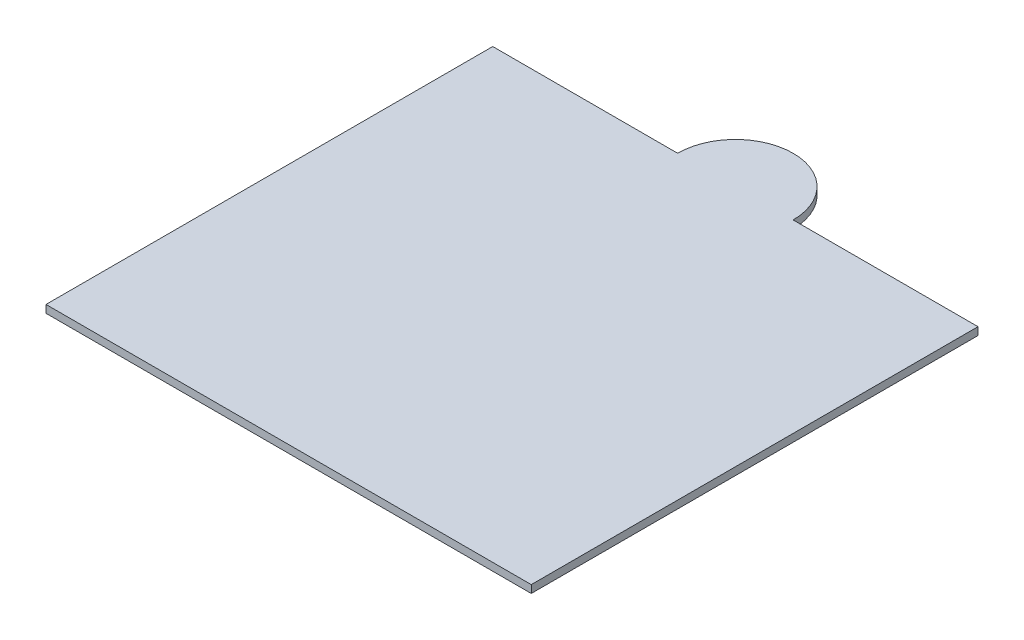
ISO-10303-21;
HEADER;
FILE_DESCRIPTION(('STEP AP214'),'2;1');
FILE_NAME('part.step','',(''),(''),'','','');
FILE_SCHEMA(('AUTOMOTIVE_DESIGN { 1 0 10303 214 1 1 1 1 }'));
ENDSEC;
DATA;
#1=APPLICATION_CONTEXT('core data for automotive mechanical design processes');
#2=APPLICATION_PROTOCOL_DEFINITION('international standard','automotive_design',2000,#1);
#3=PRODUCT_CONTEXT('',#1,'mechanical');
#4=PRODUCT('Part','Part','',(#3));
#5=PRODUCT_RELATED_PRODUCT_CATEGORY('part','',(#4));
#6=PRODUCT_DEFINITION_FORMATION('','',#4);
#7=PRODUCT_DEFINITION_CONTEXT('part definition',#1,'design');
#8=PRODUCT_DEFINITION('design','',#6,#7);
#9=PRODUCT_DEFINITION_SHAPE('','',#8);
#10=(LENGTH_UNIT() NAMED_UNIT(*) SI_UNIT(.MILLI.,.METRE.));
#11=(NAMED_UNIT(*) PLANE_ANGLE_UNIT() SI_UNIT($,.RADIAN.));
#12=(NAMED_UNIT(*) SI_UNIT($,.STERADIAN.) SOLID_ANGLE_UNIT());
#13=UNCERTAINTY_MEASURE_WITH_UNIT(LENGTH_MEASURE(1.E-05),#10,'distance_accuracy_value','');
#14=(GEOMETRIC_REPRESENTATION_CONTEXT(3) GLOBAL_UNCERTAINTY_ASSIGNED_CONTEXT((#13)) GLOBAL_UNIT_ASSIGNED_CONTEXT((#10,
#11,#12)) REPRESENTATION_CONTEXT('',''));
#15=CARTESIAN_POINT('',(0.,0.,0.));
#16=DIRECTION('',(0.,0.,1.));
#17=DIRECTION('',(1.,0.,0.));
#18=AXIS2_PLACEMENT_3D('',#15,#16,#17);
#19=CARTESIAN_POINT('',(0.,1.,-29.));
#20=DIRECTION('',(0.,-1.,0.));
#21=DIRECTION('',(0.,0.,-1.));
#22=AXIS2_PLACEMENT_3D('',#19,#20,#21);
#23=CYLINDRICAL_SURFACE('',#22,7.5);
#24=CARTESIAN_POINT('',(0.,0.,-29.));
#25=DIRECTION('',(0.,1.,0.));
#26=DIRECTION('',(0.,0.,1.));
#27=AXIS2_PLACEMENT_3D('',#24,#25,#26);
#28=CIRCLE('',#27,7.5);
#29=CARTESIAN_POINT('',(-7.50000000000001,0.,-29.));
#30=VERTEX_POINT('',#29);
#31=CARTESIAN_POINT('',(7.49999999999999,0.,-29.));
#32=VERTEX_POINT('',#31);
#33=EDGE_CURVE('E160',#30,#32,#28,.F.);
#34=ORIENTED_EDGE('',*,*,#33,.F.);
#35=DIRECTION('',(0.,-1.,0.));
#36=VECTOR('',#35,1.);
#37=CARTESIAN_POINT('',(-7.50000000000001,1.,-29.));
#38=LINE('',#37,#36);
#39=CARTESIAN_POINT('',(-7.50000000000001,1.,-29.));
#40=VERTEX_POINT('',#39);
#41=EDGE_CURVE('E12',#40,#30,#38,.T.);
#42=ORIENTED_EDGE('',*,*,#41,.F.);
#43=CARTESIAN_POINT('',(0.,1.,-29.));
#44=DIRECTION('',(0.,1.,0.));
#45=DIRECTION('',(0.,0.,1.));
#46=AXIS2_PLACEMENT_3D('',#43,#44,#45);
#47=CIRCLE('',#46,7.5);
#48=CARTESIAN_POINT('',(7.49999999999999,1.,-29.));
#49=VERTEX_POINT('',#48);
#50=EDGE_CURVE('E162',#40,#49,#47,.F.);
#51=ORIENTED_EDGE('',*,*,#50,.T.);
#52=DIRECTION('',(0.,-1.,0.));
#53=VECTOR('',#52,1.);
#54=CARTESIAN_POINT('',(7.49999999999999,1.,-29.));
#55=LINE('',#54,#53);
#56=EDGE_CURVE('E76',#49,#32,#55,.T.);
#57=ORIENTED_EDGE('',*,*,#56,.T.);
#58=EDGE_LOOP('',(#34,#42,#51,#57));
#59=FACE_BOUND('',#58,.T.);
#60=ADVANCED_FACE('F65',(#59),#23,.T.);
#61=CARTESIAN_POINT('',(0.,0.,0.));
#62=DIRECTION('',(0.,1.,0.));
#63=DIRECTION('',(0.,0.,1.));
#64=AXIS2_PLACEMENT_3D('',#61,#62,#63);
#65=PLANE('',#64);
#66=ORIENTED_EDGE('',*,*,#33,.T.);
#67=DIRECTION('',(-1.,0.,0.));
#68=VECTOR('',#67,1.);
#69=CARTESIAN_POINT('',(31.5,0.,-29.));
#70=LINE('',#69,#68);
#71=CARTESIAN_POINT('',(31.5,0.,-29.));
#72=VERTEX_POINT('',#71);
#73=EDGE_CURVE('E136',#72,#32,#70,.T.);
#74=ORIENTED_EDGE('',*,*,#73,.F.);
#75=DIRECTION('',(0.,0.,-1.));
#76=VECTOR('',#75,1.);
#77=CARTESIAN_POINT('',(31.5,0.,29.));
#78=LINE('',#77,#76);
#79=CARTESIAN_POINT('',(31.5,0.,29.));
#80=VERTEX_POINT('',#79);
#81=EDGE_CURVE('E123',#80,#72,#78,.T.);
#82=ORIENTED_EDGE('',*,*,#81,.F.);
#83=DIRECTION('',(-1.,0.,0.));
#84=VECTOR('',#83,1.);
#85=CARTESIAN_POINT('',(31.5,0.,29.));
#86=LINE('',#85,#84);
#87=CARTESIAN_POINT('',(-31.5,0.,29.));
#88=VERTEX_POINT('',#87);
#89=EDGE_CURVE('E135',#80,#88,#86,.T.);
#90=ORIENTED_EDGE('',*,*,#89,.T.);
#91=DIRECTION('',(0.,0.,-1.));
#92=VECTOR('',#91,1.);
#93=CARTESIAN_POINT('',(-31.5,0.,29.));
#94=LINE('',#93,#92);
#95=CARTESIAN_POINT('',(-31.5,0.,-29.));
#96=VERTEX_POINT('',#95);
#97=EDGE_CURVE('E143',#88,#96,#94,.T.);
#98=ORIENTED_EDGE('',*,*,#97,.T.);
#99=EDGE_CURVE('E139',#30,#96,#70,.T.);
#100=ORIENTED_EDGE('',*,*,#99,.F.);
#101=EDGE_LOOP('',(#66,#74,#82,#90,#98,#100));
#102=FACE_BOUND('',#101,.T.);
#103=ADVANCED_FACE('F133',(#102),#65,.F.);
#104=CARTESIAN_POINT('',(0.,1.,0.));
#105=DIRECTION('',(0.,1.,0.));
#106=DIRECTION('',(0.,0.,1.));
#107=AXIS2_PLACEMENT_3D('',#104,#105,#106);
#108=PLANE('',#107);
#109=ORIENTED_EDGE('',*,*,#50,.F.);
#110=DIRECTION('',(-1.,0.,0.));
#111=VECTOR('',#110,1.);
#112=CARTESIAN_POINT('',(31.5,1.,-29.));
#113=LINE('',#112,#111);
#114=CARTESIAN_POINT('',(-31.5,1.,-29.));
#115=VERTEX_POINT('',#114);
#116=EDGE_CURVE('E147',#40,#115,#113,.T.);
#117=ORIENTED_EDGE('',*,*,#116,.T.);
#118=DIRECTION('',(0.,0.,-1.));
#119=VECTOR('',#118,1.);
#120=CARTESIAN_POINT('',(-31.5,1.,29.));
#121=LINE('',#120,#119);
#122=CARTESIAN_POINT('',(-31.5,1.,29.));
#123=VERTEX_POINT('',#122);
#124=EDGE_CURVE('E175',#123,#115,#121,.T.);
#125=ORIENTED_EDGE('',*,*,#124,.F.);
#126=DIRECTION('',(-1.,0.,0.));
#127=VECTOR('',#126,1.);
#128=CARTESIAN_POINT('',(31.5,1.,29.));
#129=LINE('',#128,#127);
#130=CARTESIAN_POINT('',(31.5,1.,29.));
#131=VERTEX_POINT('',#130);
#132=EDGE_CURVE('E128',#131,#123,#129,.T.);
#133=ORIENTED_EDGE('',*,*,#132,.F.);
#134=DIRECTION('',(0.,0.,-1.));
#135=VECTOR('',#134,1.);
#136=CARTESIAN_POINT('',(31.5,1.,29.));
#137=LINE('',#136,#135);
#138=CARTESIAN_POINT('',(31.5,1.,-29.));
#139=VERTEX_POINT('',#138);
#140=EDGE_CURVE('E125',#131,#139,#137,.T.);
#141=ORIENTED_EDGE('',*,*,#140,.T.);
#142=EDGE_CURVE('E172',#139,#49,#113,.T.);
#143=ORIENTED_EDGE('',*,*,#142,.T.);
#144=EDGE_LOOP('',(#109,#117,#125,#133,#141,#143));
#145=FACE_BOUND('',#144,.T.);
#146=ADVANCED_FACE('F187',(#145),#108,.T.);
#147=CARTESIAN_POINT('',(31.5,1.,-29.));
#148=DIRECTION('',(0.,0.,1.));
#149=DIRECTION('',(1.,0.,0.));
#150=AXIS2_PLACEMENT_3D('',#147,#148,#149);
#151=PLANE('',#150);
#152=ORIENTED_EDGE('',*,*,#56,.F.);
#153=ORIENTED_EDGE('',*,*,#142,.F.);
#154=DIRECTION('',(0.,-1.,0.));
#155=VECTOR('',#154,1.);
#156=CARTESIAN_POINT('',(31.5,1.,-29.));
#157=LINE('',#156,#155);
#158=EDGE_CURVE('E69',#139,#72,#157,.T.);
#159=ORIENTED_EDGE('',*,*,#158,.T.);
#160=ORIENTED_EDGE('',*,*,#73,.T.);
#161=EDGE_LOOP('',(#152,#153,#159,#160));
#162=FACE_BOUND('',#161,.T.);
#163=ADVANCED_FACE('F189',(#162),#151,.F.);
#164=ORIENTED_EDGE('',*,*,#41,.T.);
#165=ORIENTED_EDGE('',*,*,#99,.T.);
#166=DIRECTION('',(0.,-1.,0.));
#167=VECTOR('',#166,1.);
#168=CARTESIAN_POINT('',(-31.5,1.,-29.));
#169=LINE('',#168,#167);
#170=EDGE_CURVE('E153',#115,#96,#169,.T.);
#171=ORIENTED_EDGE('',*,*,#170,.F.);
#172=ORIENTED_EDGE('',*,*,#116,.F.);
#173=EDGE_LOOP('',(#164,#165,#171,#172));
#174=FACE_BOUND('',#173,.T.);
#175=ADVANCED_FACE('F182',(#174),#151,.F.);
#176=CARTESIAN_POINT('',(-31.5,1.,29.));
#177=DIRECTION('',(-1.,0.,0.));
#178=DIRECTION('',(0.,0.,1.));
#179=AXIS2_PLACEMENT_3D('',#176,#177,#178);
#180=PLANE('',#179);
#181=ORIENTED_EDGE('',*,*,#97,.F.);
#182=DIRECTION('',(0.,-1.,0.));
#183=VECTOR('',#182,1.);
#184=CARTESIAN_POINT('',(-31.5,1.,29.));
#185=LINE('',#184,#183);
#186=EDGE_CURVE('E114',#123,#88,#185,.T.);
#187=ORIENTED_EDGE('',*,*,#186,.F.);
#188=ORIENTED_EDGE('',*,*,#124,.T.);
#189=ORIENTED_EDGE('',*,*,#170,.T.);
#190=EDGE_LOOP('',(#181,#187,#188,#189));
#191=FACE_BOUND('',#190,.T.);
#192=ADVANCED_FACE('F191',(#191),#180,.T.);
#193=CARTESIAN_POINT('',(31.5,1.,29.));
#194=DIRECTION('',(0.,0.,1.));
#195=DIRECTION('',(1.,0.,0.));
#196=AXIS2_PLACEMENT_3D('',#193,#194,#195);
#197=PLANE('',#196);
#198=ORIENTED_EDGE('',*,*,#89,.F.);
#199=DIRECTION('',(0.,-1.,0.));
#200=VECTOR('',#199,1.);
#201=CARTESIAN_POINT('',(31.5,1.,29.));
#202=LINE('',#201,#200);
#203=EDGE_CURVE('E120',#131,#80,#202,.T.);
#204=ORIENTED_EDGE('',*,*,#203,.F.);
#205=ORIENTED_EDGE('',*,*,#132,.T.);
#206=ORIENTED_EDGE('',*,*,#186,.T.);
#207=EDGE_LOOP('',(#198,#204,#205,#206));
#208=FACE_BOUND('',#207,.T.);
#209=ADVANCED_FACE('F141',(#208),#197,.T.);
#210=CARTESIAN_POINT('',(31.5,1.,29.));
#211=DIRECTION('',(-1.,0.,0.));
#212=DIRECTION('',(0.,0.,1.));
#213=AXIS2_PLACEMENT_3D('',#210,#211,#212);
#214=PLANE('',#213);
#215=ORIENTED_EDGE('',*,*,#81,.T.);
#216=ORIENTED_EDGE('',*,*,#158,.F.);
#217=ORIENTED_EDGE('',*,*,#140,.F.);
#218=ORIENTED_EDGE('',*,*,#203,.T.);
#219=EDGE_LOOP('',(#215,#216,#217,#218));
#220=FACE_BOUND('',#219,.T.);
#221=ADVANCED_FACE('F67',(#220),#214,.F.);
#222=CLOSED_SHELL('',(#60,#103,#146,#163,#175,#192,#209,#221));
#223=MANIFOLD_SOLID_BREP('B2',#222);
#224=ADVANCED_BREP_SHAPE_REPRESENTATION('',(#18,#223),#14);
#225=SHAPE_DEFINITION_REPRESENTATION(#9,#224);
ENDSEC;
END-ISO-10303-21;
